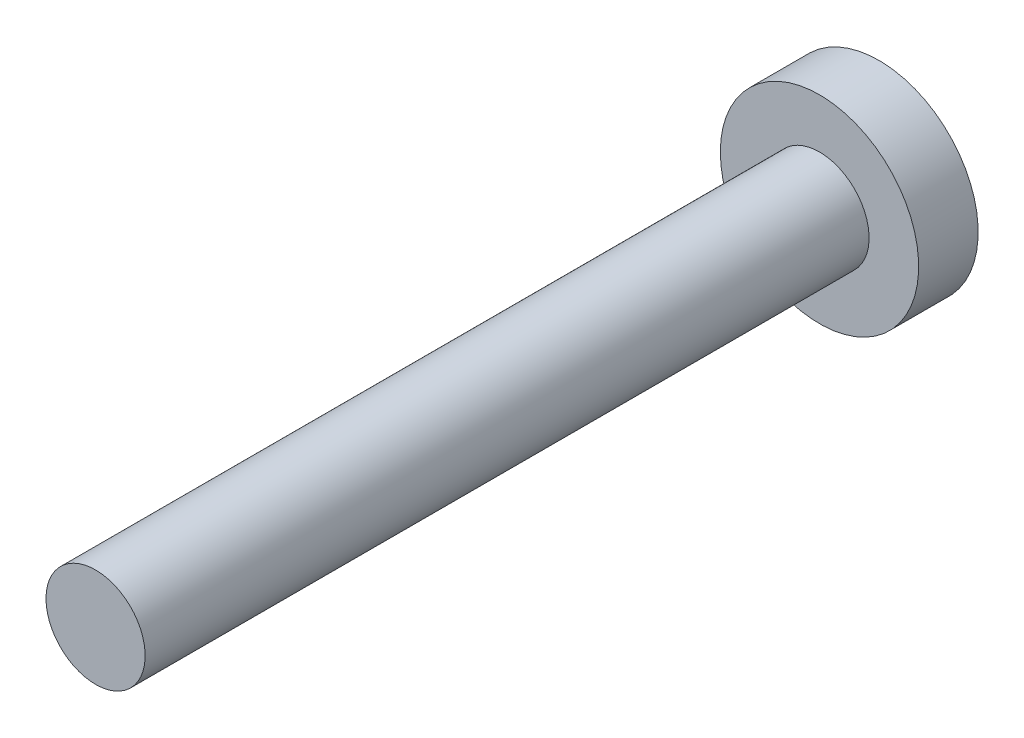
from build123d import *

# Parameters (mm, degrees)
ESQUISSE1_R      = 5
EXTRUSION1_DEPTH = 3
ESQUISSE2_R      = 2.5
EXTRUSION2_DEPTH = 36.5


with BuildPart() as part:
    # Esquisse1 → Extrusion1 (new body)
    with BuildSketch(Plane.XY):
        Circle(ESQUISSE1_R)
    extrude(amount=EXTRUSION1_DEPTH)

    # Esquisse2 → Extrusion2 (add)
    with BuildSketch(Plane.XY.offset(3)):
        Circle(ESQUISSE2_R)
    extrude(amount=EXTRUSION2_DEPTH)


solid = part.part
